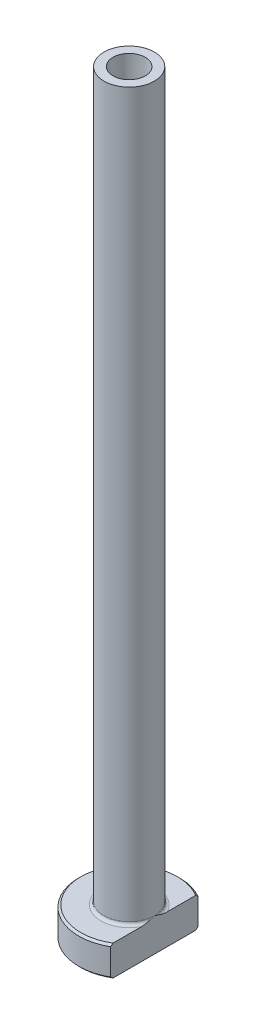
from build123d import *

# Parameters (mm, degrees)
FILLET1_R          = 0.3
CHAMFER1_SIZE      = 0.2
CUT_EXTRUDE1_DEPTH = 76.332595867
CHAMFER2_SIZE      = 0.5


with BuildPart() as part:
    # Sketch1 → Revolve1 (revolve)
    with BuildSketch(Plane.XY, mode=Mode.PRIVATE) as revolve1_sk:
        Polygon((-1.6, 75), (-2.5, 75), (-2.5, 3), (-5, 3), (-5, 0), (-1.85, 0), (-1.85, 18), (-1.6, 30), align=None)
    revolve(revolve1_sk.sketch.rotate(Axis((0, 92.187680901, 0), (0, -1, 0)), 270), axis=Axis((0, 92.187680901, 0), (0, -1, 0)))

    # Fillet1
    fillet1_edges = [part.edges().sort_by_distance(p)[0] for p in [
        (0, 3, -2.5),
    ]]
    fillet(fillet1_edges, radius=FILLET1_R)

    # Chamfer1
    chamfer1_edges = [part.edges().sort_by_distance(p)[0] for p in [
        (0, 0, -5),
        (0, 3, -5),
    ]]
    chamfer(chamfer1_edges, length=CHAMFER1_SIZE)

    # Sketch2 → Cut-Extrude1 (cut, through all)
    with BuildSketch(Plane.XZ):
        with BuildLine():
            Line((2.5, 4.330127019), (2.5, -4.330127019))
            ThreePointArc((2.5, -4.330127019), (5, 0), (2.5, 4.330127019))
        make_face()
    extrude(amount=-CUT_EXTRUDE1_DEPTH, mode=Mode.SUBTRACT)

    # Chamfer2
    chamfer2_edges = [part.edges().sort_by_distance(p)[0] for p in [
        (0, 0, -1.85),
    ]]
    chamfer(chamfer2_edges, length=CHAMFER2_SIZE)


solid = part.part
